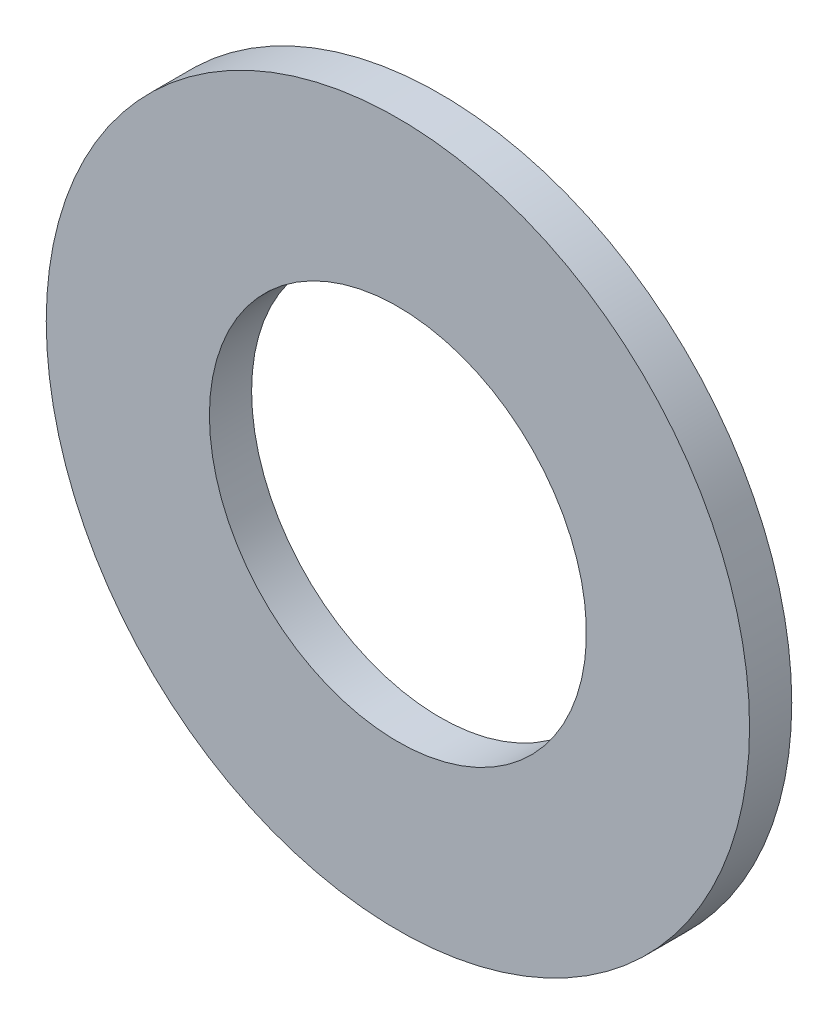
from build123d import *

# Parameters (mm, degrees)
SKETCH1_R           = 6.35
SKETCH1_R_2         = 3.4036
BOSS_EXTRUDE1_DEPTH = 0.762


with BuildPart() as part:
    # Sketch1 → Boss-Extrude1 (new body)
    with BuildSketch(Plane.XY):
        with Locations(Location((0, 0, 0), (0, 0, 180))):
            Circle(SKETCH1_R)
        with Locations(Location((0, 0, 0), (0, 0, 180))):
            Circle(SKETCH1_R_2, mode=Mode.SUBTRACT)
    extrude(amount=BOSS_EXTRUDE1_DEPTH)


solid = part.part
